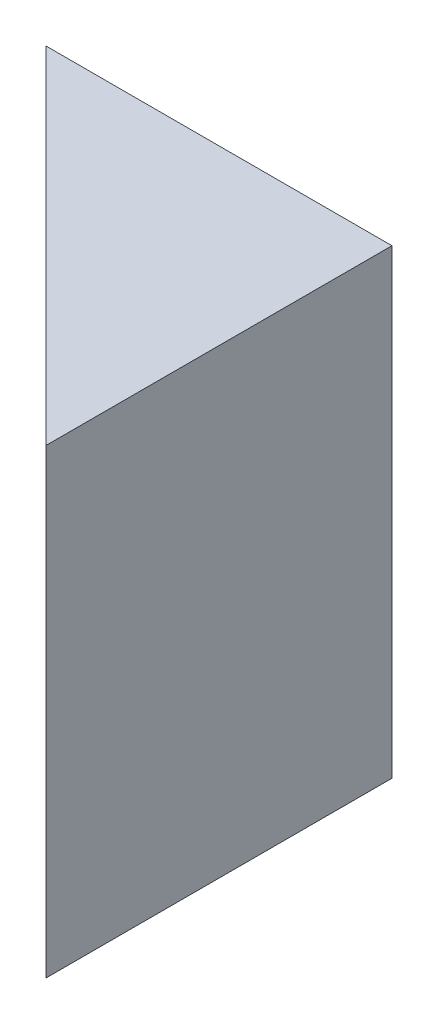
ISO-10303-21;
HEADER;
FILE_DESCRIPTION(('STEP AP214'),'2;1');
FILE_NAME('part.step','',(''),(''),'','','');
FILE_SCHEMA(('AUTOMOTIVE_DESIGN { 1 0 10303 214 1 1 1 1 }'));
ENDSEC;
DATA;
#1=APPLICATION_CONTEXT('core data for automotive mechanical design processes');
#2=APPLICATION_PROTOCOL_DEFINITION('international standard','automotive_design',2000,#1);
#3=PRODUCT_CONTEXT('',#1,'mechanical');
#4=PRODUCT('Part','Part','',(#3));
#5=PRODUCT_RELATED_PRODUCT_CATEGORY('part','',(#4));
#6=PRODUCT_DEFINITION_FORMATION('','',#4);
#7=PRODUCT_DEFINITION_CONTEXT('part definition',#1,'design');
#8=PRODUCT_DEFINITION('design','',#6,#7);
#9=PRODUCT_DEFINITION_SHAPE('','',#8);
#10=(LENGTH_UNIT() NAMED_UNIT(*) SI_UNIT(.MILLI.,.METRE.));
#11=(NAMED_UNIT(*) PLANE_ANGLE_UNIT() SI_UNIT($,.RADIAN.));
#12=(NAMED_UNIT(*) SI_UNIT($,.STERADIAN.) SOLID_ANGLE_UNIT());
#13=UNCERTAINTY_MEASURE_WITH_UNIT(LENGTH_MEASURE(1.E-05),#10,'distance_accuracy_value','');
#14=(GEOMETRIC_REPRESENTATION_CONTEXT(3) GLOBAL_UNCERTAINTY_ASSIGNED_CONTEXT((#13)) GLOBAL_UNIT_ASSIGNED_CONTEXT((#10,
#11,#12)) REPRESENTATION_CONTEXT('',''));
#15=CARTESIAN_POINT('',(0.,0.,0.));
#16=DIRECTION('',(0.,0.,1.));
#17=DIRECTION('',(1.,0.,0.));
#18=AXIS2_PLACEMENT_3D('',#15,#16,#17);
#19=CARTESIAN_POINT('',(38.1,101.6,-38.1));
#20=DIRECTION('',(-1.,0.,0.));
#21=DIRECTION('',(0.,0.,1.));
#22=AXIS2_PLACEMENT_3D('',#19,#20,#21);
#23=PLANE('',#22);
#24=DIRECTION('',(0.,0.,-1.));
#25=VECTOR('',#24,1.);
#26=CARTESIAN_POINT('',(38.1,0.,-38.1));
#27=LINE('',#26,#25);
#28=CARTESIAN_POINT('',(38.1,0.,38.1));
#29=VERTEX_POINT('',#28);
#30=CARTESIAN_POINT('',(38.1,0.,-38.1));
#31=VERTEX_POINT('',#30);
#32=EDGE_CURVE('E80',#29,#31,#27,.T.);
#33=ORIENTED_EDGE('',*,*,#32,.T.);
#34=DIRECTION('',(0.,-1.,0.));
#35=VECTOR('',#34,1.);
#36=CARTESIAN_POINT('',(38.1,101.6,-38.1));
#37=LINE('',#36,#35);
#38=CARTESIAN_POINT('',(38.1,101.6,-38.1));
#39=VERTEX_POINT('',#38);
#40=EDGE_CURVE('E11',#39,#31,#37,.T.);
#41=ORIENTED_EDGE('',*,*,#40,.F.);
#42=DIRECTION('',(0.,0.,-1.));
#43=VECTOR('',#42,1.);
#44=CARTESIAN_POINT('',(38.1,101.6,-38.1));
#45=LINE('',#44,#43);
#46=CARTESIAN_POINT('',(38.1,101.6,38.1));
#47=VERTEX_POINT('',#46);
#48=EDGE_CURVE('E73',#47,#39,#45,.T.);
#49=ORIENTED_EDGE('',*,*,#48,.F.);
#50=DIRECTION('',(0.,-1.,0.));
#51=VECTOR('',#50,1.);
#52=CARTESIAN_POINT('',(38.1,101.6,38.1));
#53=LINE('',#52,#51);
#54=EDGE_CURVE('E81',#47,#29,#53,.T.);
#55=ORIENTED_EDGE('',*,*,#54,.T.);
#56=EDGE_LOOP('',(#33,#41,#49,#55));
#57=FACE_BOUND('',#56,.T.);
#58=ADVANCED_FACE('F33',(#57),#23,.F.);
#59=CARTESIAN_POINT('',(-38.1,101.6,-38.1));
#60=DIRECTION('',(0.,0.,1.));
#61=DIRECTION('',(1.,0.,0.));
#62=AXIS2_PLACEMENT_3D('',#59,#60,#61);
#63=PLANE('',#62);
#64=DIRECTION('',(-1.,0.,0.));
#65=VECTOR('',#64,1.);
#66=CARTESIAN_POINT('',(-38.1,0.,-38.1));
#67=LINE('',#66,#65);
#68=CARTESIAN_POINT('',(-38.1,0.,-38.1));
#69=VERTEX_POINT('',#68);
#70=EDGE_CURVE('E61',#31,#69,#67,.T.);
#71=ORIENTED_EDGE('',*,*,#70,.T.);
#72=DIRECTION('',(0.,-1.,0.));
#73=VECTOR('',#72,1.);
#74=CARTESIAN_POINT('',(-38.1,101.6,-38.1));
#75=LINE('',#74,#73);
#76=CARTESIAN_POINT('',(-38.1,101.6,-38.1));
#77=VERTEX_POINT('',#76);
#78=EDGE_CURVE('E41',#77,#69,#75,.T.);
#79=ORIENTED_EDGE('',*,*,#78,.F.);
#80=DIRECTION('',(-1.,0.,0.));
#81=VECTOR('',#80,1.);
#82=CARTESIAN_POINT('',(-38.1,101.6,-38.1));
#83=LINE('',#82,#81);
#84=EDGE_CURVE('E69',#39,#77,#83,.T.);
#85=ORIENTED_EDGE('',*,*,#84,.F.);
#86=ORIENTED_EDGE('',*,*,#40,.T.);
#87=EDGE_LOOP('',(#71,#79,#85,#86));
#88=FACE_BOUND('',#87,.T.);
#89=ADVANCED_FACE('F70',(#88),#63,.F.);
#90=CARTESIAN_POINT('',(-38.1,101.6,-38.1));
#91=DIRECTION('',(0.707106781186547,0.,-0.707106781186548));
#92=DIRECTION('',(-0.707106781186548,0.,-0.707106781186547));
#93=AXIS2_PLACEMENT_3D('',#90,#91,#92);
#94=PLANE('',#93);
#95=DIRECTION('',(0.707106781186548,0.,0.707106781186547));
#96=VECTOR('',#95,1.);
#97=CARTESIAN_POINT('',(-38.1,0.,-38.1));
#98=LINE('',#97,#96);
#99=EDGE_CURVE('E66',#69,#29,#98,.T.);
#100=ORIENTED_EDGE('',*,*,#99,.T.);
#101=ORIENTED_EDGE('',*,*,#54,.F.);
#102=DIRECTION('',(0.707106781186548,0.,0.707106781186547));
#103=VECTOR('',#102,1.);
#104=CARTESIAN_POINT('',(-38.1,101.6,-38.1));
#105=LINE('',#104,#103);
#106=EDGE_CURVE('E49',#77,#47,#105,.T.);
#107=ORIENTED_EDGE('',*,*,#106,.F.);
#108=ORIENTED_EDGE('',*,*,#78,.T.);
#109=EDGE_LOOP('',(#100,#101,#107,#108));
#110=FACE_BOUND('',#109,.T.);
#111=ADVANCED_FACE('F88',(#110),#94,.F.);
#112=CARTESIAN_POINT('',(0.,101.6,0.));
#113=DIRECTION('',(0.,1.,0.));
#114=DIRECTION('',(0.,0.,1.));
#115=AXIS2_PLACEMENT_3D('',#112,#113,#114);
#116=PLANE('',#115);
#117=ORIENTED_EDGE('',*,*,#48,.T.);
#118=ORIENTED_EDGE('',*,*,#84,.T.);
#119=ORIENTED_EDGE('',*,*,#106,.T.);
#120=EDGE_LOOP('',(#117,#118,#119));
#121=FACE_BOUND('',#120,.T.);
#122=ADVANCED_FACE('F76',(#121),#116,.T.);
#123=CARTESIAN_POINT('',(0.,0.,0.));
#124=DIRECTION('',(0.,1.,0.));
#125=DIRECTION('',(0.,0.,1.));
#126=AXIS2_PLACEMENT_3D('',#123,#124,#125);
#127=PLANE('',#126);
#128=ORIENTED_EDGE('',*,*,#32,.F.);
#129=ORIENTED_EDGE('',*,*,#99,.F.);
#130=ORIENTED_EDGE('',*,*,#70,.F.);
#131=EDGE_LOOP('',(#128,#129,#130));
#132=FACE_BOUND('',#131,.T.);
#133=ADVANCED_FACE('F89',(#132),#127,.F.);
#134=CLOSED_SHELL('',(#58,#89,#111,#122,#133));
#135=MANIFOLD_SOLID_BREP('B2',#134);
#136=ADVANCED_BREP_SHAPE_REPRESENTATION('',(#18,#135),#14);
#137=SHAPE_DEFINITION_REPRESENTATION(#9,#136);
ENDSEC;
END-ISO-10303-21;
